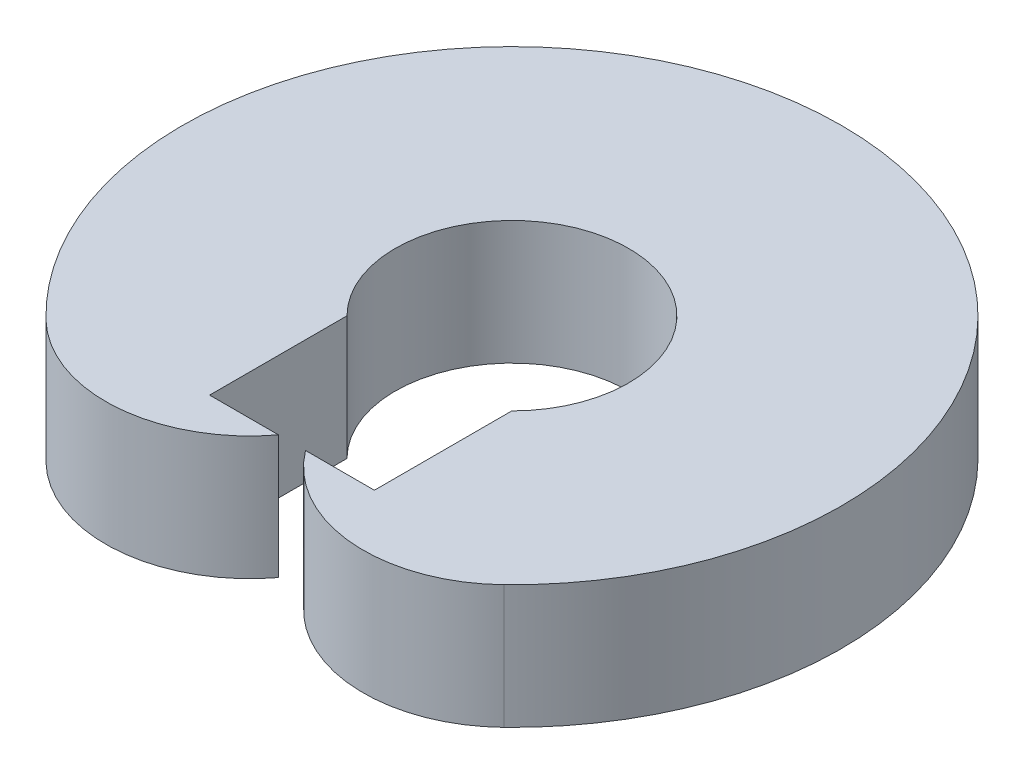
ISO-10303-21;
HEADER;
FILE_DESCRIPTION(('STEP AP214'),'2;1');
FILE_NAME('part.step','',(''),(''),'','','');
FILE_SCHEMA(('AUTOMOTIVE_DESIGN { 1 0 10303 214 1 1 1 1 }'));
ENDSEC;
DATA;
#1=APPLICATION_CONTEXT('core data for automotive mechanical design processes');
#2=APPLICATION_PROTOCOL_DEFINITION('international standard','automotive_design',2000,#1);
#3=PRODUCT_CONTEXT('',#1,'mechanical');
#4=PRODUCT('Part','Part','',(#3));
#5=PRODUCT_RELATED_PRODUCT_CATEGORY('part','',(#4));
#6=PRODUCT_DEFINITION_FORMATION('','',#4);
#7=PRODUCT_DEFINITION_CONTEXT('part definition',#1,'design');
#8=PRODUCT_DEFINITION('design','',#6,#7);
#9=PRODUCT_DEFINITION_SHAPE('','',#8);
#10=(LENGTH_UNIT() NAMED_UNIT(*) SI_UNIT(.MILLI.,.METRE.));
#11=(NAMED_UNIT(*) PLANE_ANGLE_UNIT() SI_UNIT($,.RADIAN.));
#12=(NAMED_UNIT(*) SI_UNIT($,.STERADIAN.) SOLID_ANGLE_UNIT());
#13=UNCERTAINTY_MEASURE_WITH_UNIT(LENGTH_MEASURE(1.E-05),#10,'distance_accuracy_value','');
#14=(GEOMETRIC_REPRESENTATION_CONTEXT(3) GLOBAL_UNCERTAINTY_ASSIGNED_CONTEXT((#13)) GLOBAL_UNIT_ASSIGNED_CONTEXT((#10,
#11,#12)) REPRESENTATION_CONTEXT('',''));
#15=CARTESIAN_POINT('',(0.,0.,0.));
#16=DIRECTION('',(0.,0.,1.));
#17=DIRECTION('',(1.,0.,0.));
#18=AXIS2_PLACEMENT_3D('',#15,#16,#17);
#19=CARTESIAN_POINT('',(156.298133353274,150.,161.851455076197));
#20=DIRECTION('',(0.,-1.,0.));
#21=DIRECTION('',(0.,0.,-1.));
#22=AXIS2_PLACEMENT_3D('',#19,#20,#21);
#23=CYLINDRICAL_SURFACE('',#22,175.);
#24=CARTESIAN_POINT('',(156.298133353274,0.,161.851455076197));
#25=DIRECTION('',(0.,1.,0.));
#26=DIRECTION('',(0.,0.,1.));
#27=AXIS2_PLACEMENT_3D('',#24,#25,#26);
#28=CIRCLE('',#27,175.);
#29=CARTESIAN_POINT('',(277.863348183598,0.,287.735920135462));
#30=VERTEX_POINT('',#29);
#31=CARTESIAN_POINT('',(16.4096652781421,0.,267.));
#32=VERTEX_POINT('',#31);
#33=EDGE_CURVE('E131',#30,#32,#28,.F.);
#34=ORIENTED_EDGE('',*,*,#33,.F.);
#35=DIRECTION('',(0.,-1.,0.));
#36=VECTOR('',#35,1.);
#37=CARTESIAN_POINT('',(277.863348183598,150.,287.735920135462));
#38=LINE('',#37,#36);
#39=CARTESIAN_POINT('',(277.863348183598,150.,287.735920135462));
#40=VERTEX_POINT('',#39);
#41=EDGE_CURVE('E11',#40,#30,#38,.T.);
#42=ORIENTED_EDGE('',*,*,#41,.F.);
#43=CARTESIAN_POINT('',(156.298133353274,150.,161.851455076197));
#44=DIRECTION('',(0.,1.,0.));
#45=DIRECTION('',(0.,0.,1.));
#46=AXIS2_PLACEMENT_3D('',#43,#44,#45);
#47=CIRCLE('',#46,175.);
#48=CARTESIAN_POINT('',(16.4096652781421,150.,267.));
#49=VERTEX_POINT('',#48);
#50=EDGE_CURVE('E150',#40,#49,#47,.F.);
#51=ORIENTED_EDGE('',*,*,#50,.T.);
#52=DIRECTION('',(0.,-1.,0.));
#53=VECTOR('',#52,1.);
#54=CARTESIAN_POINT('',(16.4096652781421,150.,267.));
#55=LINE('',#54,#53);
#56=EDGE_CURVE('E51',#49,#32,#55,.T.);
#57=ORIENTED_EDGE('',*,*,#56,.T.);
#58=EDGE_LOOP('',(#34,#42,#51,#57));
#59=FACE_BOUND('',#58,.T.);
#60=ADVANCED_FACE('F35',(#59),#23,.T.);
#61=CARTESIAN_POINT('',(0.,150.,0.));
#62=DIRECTION('',(0.,-1.,0.));
#63=DIRECTION('',(0.,0.,-1.));
#64=AXIS2_PLACEMENT_3D('',#61,#62,#63);
#65=CYLINDRICAL_SURFACE('',#64,400.);
#66=CARTESIAN_POINT('',(0.,0.,0.));
#67=DIRECTION('',(0.,1.,0.));
#68=DIRECTION('',(0.,0.,1.));
#69=AXIS2_PLACEMENT_3D('',#66,#67,#68);
#70=CIRCLE('',#69,400.);
#71=CARTESIAN_POINT('',(-277.863348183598,0.,287.735920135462));
#72=VERTEX_POINT('',#71);
#73=EDGE_CURVE('E133',#30,#72,#70,.T.);
#74=ORIENTED_EDGE('',*,*,#73,.T.);
#75=DIRECTION('',(0.,-1.,0.));
#76=VECTOR('',#75,1.);
#77=CARTESIAN_POINT('',(-277.863348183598,150.,287.735920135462));
#78=LINE('',#77,#76);
#79=CARTESIAN_POINT('',(-277.863348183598,150.,287.735920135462));
#80=VERTEX_POINT('',#79);
#81=EDGE_CURVE('E43',#80,#72,#78,.T.);
#82=ORIENTED_EDGE('',*,*,#81,.F.);
#83=CARTESIAN_POINT('',(0.,150.,0.));
#84=DIRECTION('',(0.,1.,0.));
#85=DIRECTION('',(0.,0.,1.));
#86=AXIS2_PLACEMENT_3D('',#83,#84,#85);
#87=CIRCLE('',#86,400.);
#88=EDGE_CURVE('E174',#40,#80,#87,.T.);
#89=ORIENTED_EDGE('',*,*,#88,.F.);
#90=ORIENTED_EDGE('',*,*,#41,.T.);
#91=EDGE_LOOP('',(#74,#82,#89,#90));
#92=FACE_BOUND('',#91,.T.);
#93=ADVANCED_FACE('F189',(#92),#65,.T.);
#94=CARTESIAN_POINT('',(-156.298133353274,150.,161.851455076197));
#95=DIRECTION('',(0.,-1.,0.));
#96=DIRECTION('',(0.,0.,-1.));
#97=AXIS2_PLACEMENT_3D('',#94,#95,#96);
#98=CYLINDRICAL_SURFACE('',#97,175.);
#99=CARTESIAN_POINT('',(-156.298133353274,0.,161.851455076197));
#100=DIRECTION('',(0.,1.,0.));
#101=DIRECTION('',(0.,0.,1.));
#102=AXIS2_PLACEMENT_3D('',#99,#100,#101);
#103=CIRCLE('',#102,175.);
#104=CARTESIAN_POINT('',(-16.4096652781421,0.,267.));
#105=VERTEX_POINT('',#104);
#106=EDGE_CURVE('E135',#72,#105,#103,.T.);
#107=ORIENTED_EDGE('',*,*,#106,.T.);
#108=DIRECTION('',(0.,-1.,0.));
#109=VECTOR('',#108,1.);
#110=CARTESIAN_POINT('',(-16.4096652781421,150.,267.));
#111=LINE('',#110,#109);
#112=CARTESIAN_POINT('',(-16.4096652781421,150.,267.));
#113=VERTEX_POINT('',#112);
#114=EDGE_CURVE('E156',#113,#105,#111,.T.);
#115=ORIENTED_EDGE('',*,*,#114,.F.);
#116=CARTESIAN_POINT('',(-156.298133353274,150.,161.851455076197));
#117=DIRECTION('',(0.,1.,0.));
#118=DIRECTION('',(0.,0.,1.));
#119=AXIS2_PLACEMENT_3D('',#116,#117,#118);
#120=CIRCLE('',#119,175.);
#121=EDGE_CURVE('E164',#80,#113,#120,.T.);
#122=ORIENTED_EDGE('',*,*,#121,.F.);
#123=ORIENTED_EDGE('',*,*,#81,.T.);
#124=EDGE_LOOP('',(#107,#115,#122,#123));
#125=FACE_BOUND('',#124,.T.);
#126=ADVANCED_FACE('F162',(#125),#98,.T.);
#127=CARTESIAN_POINT('',(-820.722508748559,150.,267.));
#128=DIRECTION('',(0.,0.,-1.));
#129=DIRECTION('',(-1.,0.,0.));
#130=AXIS2_PLACEMENT_3D('',#127,#128,#129);
#131=PLANE('',#130);
#132=DIRECTION('',(1.,0.,0.));
#133=VECTOR('',#132,1.);
#134=CARTESIAN_POINT('',(-820.722508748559,0.,267.));
#135=LINE('',#134,#133);
#136=CARTESIAN_POINT('',(-99.9999999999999,0.,267.));
#137=VERTEX_POINT('',#136);
#138=EDGE_CURVE('E138',#137,#105,#135,.T.);
#139=ORIENTED_EDGE('',*,*,#138,.F.);
#140=DIRECTION('',(0.,-1.,0.));
#141=VECTOR('',#140,1.);
#142=CARTESIAN_POINT('',(-99.9999999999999,150.,267.));
#143=LINE('',#142,#141);
#144=CARTESIAN_POINT('',(-99.9999999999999,150.,267.));
#145=VERTEX_POINT('',#144);
#146=EDGE_CURVE('E154',#145,#137,#143,.T.);
#147=ORIENTED_EDGE('',*,*,#146,.F.);
#148=DIRECTION('',(1.,0.,0.));
#149=VECTOR('',#148,1.);
#150=CARTESIAN_POINT('',(-820.722508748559,150.,267.));
#151=LINE('',#150,#149);
#152=EDGE_CURVE('E126',#145,#113,#151,.T.);
#153=ORIENTED_EDGE('',*,*,#152,.T.);
#154=ORIENTED_EDGE('',*,*,#114,.T.);
#155=EDGE_LOOP('',(#139,#147,#153,#154));
#156=FACE_BOUND('',#155,.T.);
#157=ADVANCED_FACE('F172',(#156),#131,.T.);
#158=CARTESIAN_POINT('',(-100.,150.,-56.1320399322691));
#159=DIRECTION('',(1.,0.,0.));
#160=DIRECTION('',(0.,0.,-1.));
#161=AXIS2_PLACEMENT_3D('',#158,#159,#160);
#162=PLANE('',#161);
#163=DIRECTION('',(0.,0.,1.));
#164=VECTOR('',#163,1.);
#165=CARTESIAN_POINT('',(-100.,0.,-56.1320399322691));
#166=LINE('',#165,#164);
#167=CARTESIAN_POINT('',(-100.,0.,100.248468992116));
#168=VERTEX_POINT('',#167);
#169=EDGE_CURVE('E141',#168,#137,#166,.T.);
#170=ORIENTED_EDGE('',*,*,#169,.F.);
#171=DIRECTION('',(0.,-1.,0.));
#172=VECTOR('',#171,1.);
#173=CARTESIAN_POINT('',(-100.,150.,100.248468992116));
#174=LINE('',#173,#172);
#175=CARTESIAN_POINT('',(-100.,150.,100.248468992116));
#176=VERTEX_POINT('',#175);
#177=EDGE_CURVE('E111',#176,#168,#174,.T.);
#178=ORIENTED_EDGE('',*,*,#177,.F.);
#179=DIRECTION('',(0.,0.,1.));
#180=VECTOR('',#179,1.);
#181=CARTESIAN_POINT('',(-100.,150.,-56.1320399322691));
#182=LINE('',#181,#180);
#183=EDGE_CURVE('E124',#176,#145,#182,.T.);
#184=ORIENTED_EDGE('',*,*,#183,.T.);
#185=ORIENTED_EDGE('',*,*,#146,.T.);
#186=EDGE_LOOP('',(#170,#178,#184,#185));
#187=FACE_BOUND('',#186,.T.);
#188=ADVANCED_FACE('F200',(#187),#162,.T.);
#189=CARTESIAN_POINT('',(0.,150.,0.));
#190=DIRECTION('',(0.,-1.,0.));
#191=DIRECTION('',(0.,0.,-1.));
#192=AXIS2_PLACEMENT_3D('',#189,#190,#191);
#193=CYLINDRICAL_SURFACE('',#192,141.597159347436);
#194=CARTESIAN_POINT('',(0.,0.,0.));
#195=DIRECTION('',(0.,1.,0.));
#196=DIRECTION('',(0.,0.,1.));
#197=AXIS2_PLACEMENT_3D('',#194,#195,#196);
#198=CIRCLE('',#197,141.597159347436);
#199=CARTESIAN_POINT('',(100.,0.,100.248468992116));
#200=VERTEX_POINT('',#199);
#201=EDGE_CURVE('E108',#200,#168,#198,.T.);
#202=ORIENTED_EDGE('',*,*,#201,.F.);
#203=DIRECTION('',(0.,-1.,0.));
#204=VECTOR('',#203,1.);
#205=CARTESIAN_POINT('',(100.,150.,100.248468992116));
#206=LINE('',#205,#204);
#207=CARTESIAN_POINT('',(100.,150.,100.248468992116));
#208=VERTEX_POINT('',#207);
#209=EDGE_CURVE('E102',#208,#200,#206,.T.);
#210=ORIENTED_EDGE('',*,*,#209,.F.);
#211=CARTESIAN_POINT('',(0.,150.,0.));
#212=DIRECTION('',(0.,1.,0.));
#213=DIRECTION('',(0.,0.,1.));
#214=AXIS2_PLACEMENT_3D('',#211,#212,#213);
#215=CIRCLE('',#214,141.597159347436);
#216=EDGE_CURVE('E106',#208,#176,#215,.T.);
#217=ORIENTED_EDGE('',*,*,#216,.T.);
#218=ORIENTED_EDGE('',*,*,#177,.T.);
#219=EDGE_LOOP('',(#202,#210,#217,#218));
#220=FACE_BOUND('',#219,.T.);
#221=ADVANCED_FACE('F104',(#220),#193,.F.);
#222=CARTESIAN_POINT('',(100.,150.,-56.1320399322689));
#223=DIRECTION('',(1.,0.,0.));
#224=DIRECTION('',(0.,0.,-1.));
#225=AXIS2_PLACEMENT_3D('',#222,#223,#224);
#226=PLANE('',#225);
#227=DIRECTION('',(0.,0.,1.));
#228=VECTOR('',#227,1.);
#229=CARTESIAN_POINT('',(100.,0.,-56.1320399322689));
#230=LINE('',#229,#228);
#231=CARTESIAN_POINT('',(99.9999999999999,0.,267.));
#232=VERTEX_POINT('',#231);
#233=EDGE_CURVE('E145',#200,#232,#230,.T.);
#234=ORIENTED_EDGE('',*,*,#233,.T.);
#235=DIRECTION('',(0.,-1.,0.));
#236=VECTOR('',#235,1.);
#237=CARTESIAN_POINT('',(99.9999999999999,150.,267.));
#238=LINE('',#237,#236);
#239=CARTESIAN_POINT('',(99.9999999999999,150.,267.));
#240=VERTEX_POINT('',#239);
#241=EDGE_CURVE('E77',#240,#232,#238,.T.);
#242=ORIENTED_EDGE('',*,*,#241,.F.);
#243=DIRECTION('',(0.,0.,1.));
#244=VECTOR('',#243,1.);
#245=CARTESIAN_POINT('',(100.,150.,-56.1320399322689));
#246=LINE('',#245,#244);
#247=EDGE_CURVE('E113',#208,#240,#246,.T.);
#248=ORIENTED_EDGE('',*,*,#247,.F.);
#249=ORIENTED_EDGE('',*,*,#209,.T.);
#250=EDGE_LOOP('',(#234,#242,#248,#249));
#251=FACE_BOUND('',#250,.T.);
#252=ADVANCED_FACE('F114',(#251),#226,.F.);
#253=CARTESIAN_POINT('',(-820.722508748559,150.,267.));
#254=DIRECTION('',(0.,0.,-1.));
#255=DIRECTION('',(-1.,0.,0.));
#256=AXIS2_PLACEMENT_3D('',#253,#254,#255);
#257=PLANE('',#256);
#258=DIRECTION('',(1.,0.,0.));
#259=VECTOR('',#258,1.);
#260=CARTESIAN_POINT('',(-820.722508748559,0.,267.));
#261=LINE('',#260,#259);
#262=EDGE_CURVE('E147',#32,#232,#261,.T.);
#263=ORIENTED_EDGE('',*,*,#262,.F.);
#264=ORIENTED_EDGE('',*,*,#56,.F.);
#265=DIRECTION('',(1.,0.,0.));
#266=VECTOR('',#265,1.);
#267=CARTESIAN_POINT('',(-820.722508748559,150.,267.));
#268=LINE('',#267,#266);
#269=EDGE_CURVE('E117',#49,#240,#268,.T.);
#270=ORIENTED_EDGE('',*,*,#269,.T.);
#271=ORIENTED_EDGE('',*,*,#241,.T.);
#272=EDGE_LOOP('',(#263,#264,#270,#271));
#273=FACE_BOUND('',#272,.T.);
#274=ADVANCED_FACE('F178',(#273),#257,.T.);
#275=CARTESIAN_POINT('',(-820.722508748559,150.,-56.132039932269));
#276=DIRECTION('',(0.,1.,0.));
#277=DIRECTION('',(0.,0.,1.));
#278=AXIS2_PLACEMENT_3D('',#275,#276,#277);
#279=PLANE('',#278);
#280=ORIENTED_EDGE('',*,*,#50,.F.);
#281=ORIENTED_EDGE('',*,*,#88,.T.);
#282=ORIENTED_EDGE('',*,*,#121,.T.);
#283=ORIENTED_EDGE('',*,*,#152,.F.);
#284=ORIENTED_EDGE('',*,*,#183,.F.);
#285=ORIENTED_EDGE('',*,*,#216,.F.);
#286=ORIENTED_EDGE('',*,*,#247,.T.);
#287=ORIENTED_EDGE('',*,*,#269,.F.);
#288=EDGE_LOOP('',(#280,#281,#282,#283,#284,#285,#286,#287));
#289=FACE_BOUND('',#288,.T.);
#290=ADVANCED_FACE('F121',(#289),#279,.T.);
#291=CARTESIAN_POINT('',(-820.722508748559,0.,-56.132039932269));
#292=DIRECTION('',(0.,1.,0.));
#293=DIRECTION('',(0.,0.,1.));
#294=AXIS2_PLACEMENT_3D('',#291,#292,#293);
#295=PLANE('',#294);
#296=ORIENTED_EDGE('',*,*,#33,.T.);
#297=ORIENTED_EDGE('',*,*,#262,.T.);
#298=ORIENTED_EDGE('',*,*,#233,.F.);
#299=ORIENTED_EDGE('',*,*,#201,.T.);
#300=ORIENTED_EDGE('',*,*,#169,.T.);
#301=ORIENTED_EDGE('',*,*,#138,.T.);
#302=ORIENTED_EDGE('',*,*,#106,.F.);
#303=ORIENTED_EDGE('',*,*,#73,.F.);
#304=EDGE_LOOP('',(#296,#297,#298,#299,#300,#301,#302,#303));
#305=FACE_BOUND('',#304,.T.);
#306=ADVANCED_FACE('F168',(#305),#295,.F.);
#307=CLOSED_SHELL('',(#60,#93,#126,#157,#188,#221,#252,#274,#290,#306));
#308=MANIFOLD_SOLID_BREP('B2',#307);
#309=ADVANCED_BREP_SHAPE_REPRESENTATION('',(#18,#308),#14);
#310=SHAPE_DEFINITION_REPRESENTATION(#9,#309);
ENDSEC;
END-ISO-10303-21;
